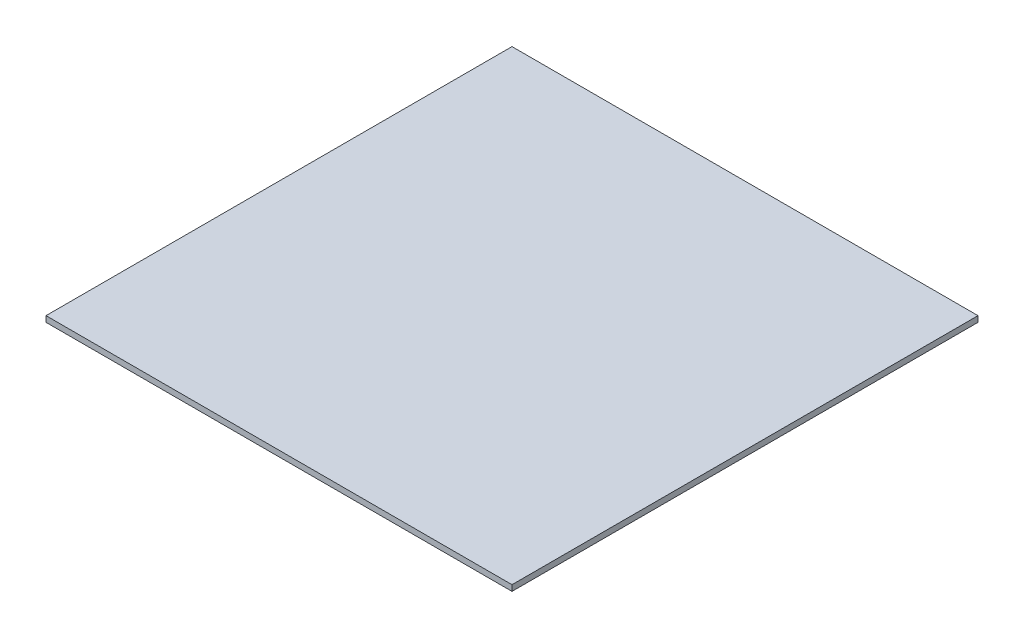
ISO-10303-21;
HEADER;
FILE_DESCRIPTION(('STEP AP214'),'2;1');
FILE_NAME('part.step','',(''),(''),'','','');
FILE_SCHEMA(('AUTOMOTIVE_DESIGN { 1 0 10303 214 1 1 1 1 }'));
ENDSEC;
DATA;
#1=APPLICATION_CONTEXT('core data for automotive mechanical design processes');
#2=APPLICATION_PROTOCOL_DEFINITION('international standard','automotive_design',2000,#1);
#3=PRODUCT_CONTEXT('',#1,'mechanical');
#4=PRODUCT('Part','Part','',(#3));
#5=PRODUCT_RELATED_PRODUCT_CATEGORY('part','',(#4));
#6=PRODUCT_DEFINITION_FORMATION('','',#4);
#7=PRODUCT_DEFINITION_CONTEXT('part definition',#1,'design');
#8=PRODUCT_DEFINITION('design','',#6,#7);
#9=PRODUCT_DEFINITION_SHAPE('','',#8);
#10=(LENGTH_UNIT() NAMED_UNIT(*) SI_UNIT(.MILLI.,.METRE.));
#11=(NAMED_UNIT(*) PLANE_ANGLE_UNIT() SI_UNIT($,.RADIAN.));
#12=(NAMED_UNIT(*) SI_UNIT($,.STERADIAN.) SOLID_ANGLE_UNIT());
#13=UNCERTAINTY_MEASURE_WITH_UNIT(LENGTH_MEASURE(1.E-05),#10,'distance_accuracy_value','');
#14=(GEOMETRIC_REPRESENTATION_CONTEXT(3) GLOBAL_UNCERTAINTY_ASSIGNED_CONTEXT((#13)) GLOBAL_UNIT_ASSIGNED_CONTEXT((#10,
#11,#12)) REPRESENTATION_CONTEXT('',''));
#15=CARTESIAN_POINT('',(0.,0.,0.));
#16=DIRECTION('',(0.,0.,1.));
#17=DIRECTION('',(1.,0.,0.));
#18=AXIS2_PLACEMENT_3D('',#15,#16,#17);
#19=CARTESIAN_POINT('',(0.,5.,0.));
#20=DIRECTION('',(1.,0.,0.));
#21=DIRECTION('',(0.,0.,-1.));
#22=AXIS2_PLACEMENT_3D('',#19,#20,#21);
#23=PLANE('',#22);
#24=DIRECTION('',(0.,0.,1.));
#25=VECTOR('',#24,1.);
#26=CARTESIAN_POINT('',(0.,0.,0.));
#27=LINE('',#26,#25);
#28=CARTESIAN_POINT('',(-1.11022302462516E-13,0.,-400.));
#29=VERTEX_POINT('',#28);
#30=CARTESIAN_POINT('',(0.,0.,0.));
#31=VERTEX_POINT('',#30);
#32=EDGE_CURVE('E96',#29,#31,#27,.T.);
#33=ORIENTED_EDGE('',*,*,#32,.T.);
#34=DIRECTION('',(0.,-1.,0.));
#35=VECTOR('',#34,1.);
#36=CARTESIAN_POINT('',(0.,5.,0.));
#37=LINE('',#36,#35);
#38=CARTESIAN_POINT('',(0.,5.,0.));
#39=VERTEX_POINT('',#38);
#40=EDGE_CURVE('E11',#39,#31,#37,.T.);
#41=ORIENTED_EDGE('',*,*,#40,.F.);
#42=DIRECTION('',(0.,0.,1.));
#43=VECTOR('',#42,1.);
#44=CARTESIAN_POINT('',(0.,5.,0.));
#45=LINE('',#44,#43);
#46=CARTESIAN_POINT('',(-1.11022302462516E-13,5.,-400.));
#47=VERTEX_POINT('',#46);
#48=EDGE_CURVE('E84',#47,#39,#45,.T.);
#49=ORIENTED_EDGE('',*,*,#48,.F.);
#50=DIRECTION('',(0.,-1.,0.));
#51=VECTOR('',#50,1.);
#52=CARTESIAN_POINT('',(-1.11022302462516E-13,5.,-400.));
#53=LINE('',#52,#51);
#54=EDGE_CURVE('E92',#47,#29,#53,.T.);
#55=ORIENTED_EDGE('',*,*,#54,.T.);
#56=EDGE_LOOP('',(#33,#41,#49,#55));
#57=FACE_BOUND('',#56,.T.);
#58=ADVANCED_FACE('F33',(#57),#23,.F.);
#59=CARTESIAN_POINT('',(0.,5.,0.));
#60=DIRECTION('',(0.,0.,-1.));
#61=DIRECTION('',(-1.,0.,0.));
#62=AXIS2_PLACEMENT_3D('',#59,#60,#61);
#63=PLANE('',#62);
#64=DIRECTION('',(1.,0.,0.));
#65=VECTOR('',#64,1.);
#66=CARTESIAN_POINT('',(0.,0.,0.));
#67=LINE('',#66,#65);
#68=CARTESIAN_POINT('',(400.,0.,0.));
#69=VERTEX_POINT('',#68);
#70=EDGE_CURVE('E88',#31,#69,#67,.T.);
#71=ORIENTED_EDGE('',*,*,#70,.T.);
#72=DIRECTION('',(0.,-1.,0.));
#73=VECTOR('',#72,1.);
#74=CARTESIAN_POINT('',(400.,5.,0.));
#75=LINE('',#74,#73);
#76=CARTESIAN_POINT('',(400.,5.,0.));
#77=VERTEX_POINT('',#76);
#78=EDGE_CURVE('E41',#77,#69,#75,.T.);
#79=ORIENTED_EDGE('',*,*,#78,.F.);
#80=DIRECTION('',(1.,0.,0.));
#81=VECTOR('',#80,1.);
#82=CARTESIAN_POINT('',(0.,5.,0.));
#83=LINE('',#82,#81);
#84=EDGE_CURVE('E79',#39,#77,#83,.T.);
#85=ORIENTED_EDGE('',*,*,#84,.F.);
#86=ORIENTED_EDGE('',*,*,#40,.T.);
#87=EDGE_LOOP('',(#71,#79,#85,#86));
#88=FACE_BOUND('',#87,.T.);
#89=ADVANCED_FACE('F87',(#88),#63,.F.);
#90=CARTESIAN_POINT('',(400.,5.,0.));
#91=DIRECTION('',(-1.,0.,0.));
#92=DIRECTION('',(0.,0.,1.));
#93=AXIS2_PLACEMENT_3D('',#90,#91,#92);
#94=PLANE('',#93);
#95=DIRECTION('',(0.,0.,-1.));
#96=VECTOR('',#95,1.);
#97=CARTESIAN_POINT('',(400.,0.,0.));
#98=LINE('',#97,#96);
#99=CARTESIAN_POINT('',(400.,0.,-400.));
#100=VERTEX_POINT('',#99);
#101=EDGE_CURVE('E66',#69,#100,#98,.T.);
#102=ORIENTED_EDGE('',*,*,#101,.T.);
#103=DIRECTION('',(0.,-1.,0.));
#104=VECTOR('',#103,1.);
#105=CARTESIAN_POINT('',(400.,5.,-400.));
#106=LINE('',#105,#104);
#107=CARTESIAN_POINT('',(400.,5.,-400.));
#108=VERTEX_POINT('',#107);
#109=EDGE_CURVE('E89',#108,#100,#106,.T.);
#110=ORIENTED_EDGE('',*,*,#109,.F.);
#111=DIRECTION('',(0.,0.,-1.));
#112=VECTOR('',#111,1.);
#113=CARTESIAN_POINT('',(400.,5.,0.));
#114=LINE('',#113,#112);
#115=EDGE_CURVE('E82',#77,#108,#114,.T.);
#116=ORIENTED_EDGE('',*,*,#115,.F.);
#117=ORIENTED_EDGE('',*,*,#78,.T.);
#118=EDGE_LOOP('',(#102,#110,#116,#117));
#119=FACE_BOUND('',#118,.T.);
#120=ADVANCED_FACE('F90',(#119),#94,.F.);
#121=CARTESIAN_POINT('',(-1.11022302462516E-13,5.,-400.));
#122=DIRECTION('',(0.,0.,1.));
#123=DIRECTION('',(1.,0.,0.));
#124=AXIS2_PLACEMENT_3D('',#121,#122,#123);
#125=PLANE('',#124);
#126=DIRECTION('',(-1.,0.,0.));
#127=VECTOR('',#126,1.);
#128=CARTESIAN_POINT('',(-1.11022302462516E-13,0.,-400.));
#129=LINE('',#128,#127);
#130=EDGE_CURVE('E72',#100,#29,#129,.T.);
#131=ORIENTED_EDGE('',*,*,#130,.T.);
#132=ORIENTED_EDGE('',*,*,#54,.F.);
#133=DIRECTION('',(-1.,0.,0.));
#134=VECTOR('',#133,1.);
#135=CARTESIAN_POINT('',(-1.11022302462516E-13,5.,-400.));
#136=LINE('',#135,#134);
#137=EDGE_CURVE('E49',#108,#47,#136,.T.);
#138=ORIENTED_EDGE('',*,*,#137,.F.);
#139=ORIENTED_EDGE('',*,*,#109,.T.);
#140=EDGE_LOOP('',(#131,#132,#138,#139));
#141=FACE_BOUND('',#140,.T.);
#142=ADVANCED_FACE('F103',(#141),#125,.F.);
#143=CARTESIAN_POINT('',(0.,5.,0.));
#144=DIRECTION('',(0.,-1.,0.));
#145=DIRECTION('',(0.,0.,-1.));
#146=AXIS2_PLACEMENT_3D('',#143,#144,#145);
#147=PLANE('',#146);
#148=ORIENTED_EDGE('',*,*,#48,.T.);
#149=ORIENTED_EDGE('',*,*,#84,.T.);
#150=ORIENTED_EDGE('',*,*,#115,.T.);
#151=ORIENTED_EDGE('',*,*,#137,.T.);
#152=EDGE_LOOP('',(#148,#149,#150,#151));
#153=FACE_BOUND('',#152,.T.);
#154=ADVANCED_FACE('F80',(#153),#147,.F.);
#155=CARTESIAN_POINT('',(0.,0.,0.));
#156=DIRECTION('',(0.,-1.,0.));
#157=DIRECTION('',(0.,0.,-1.));
#158=AXIS2_PLACEMENT_3D('',#155,#156,#157);
#159=PLANE('',#158);
#160=ORIENTED_EDGE('',*,*,#32,.F.);
#161=ORIENTED_EDGE('',*,*,#130,.F.);
#162=ORIENTED_EDGE('',*,*,#101,.F.);
#163=ORIENTED_EDGE('',*,*,#70,.F.);
#164=EDGE_LOOP('',(#160,#161,#162,#163));
#165=FACE_BOUND('',#164,.T.);
#166=ADVANCED_FACE('F106',(#165),#159,.T.);
#167=CLOSED_SHELL('',(#58,#89,#120,#142,#154,#166));
#168=MANIFOLD_SOLID_BREP('B2',#167);
#169=ADVANCED_BREP_SHAPE_REPRESENTATION('',(#18,#168),#14);
#170=SHAPE_DEFINITION_REPRESENTATION(#9,#169);
ENDSEC;
END-ISO-10303-21;
